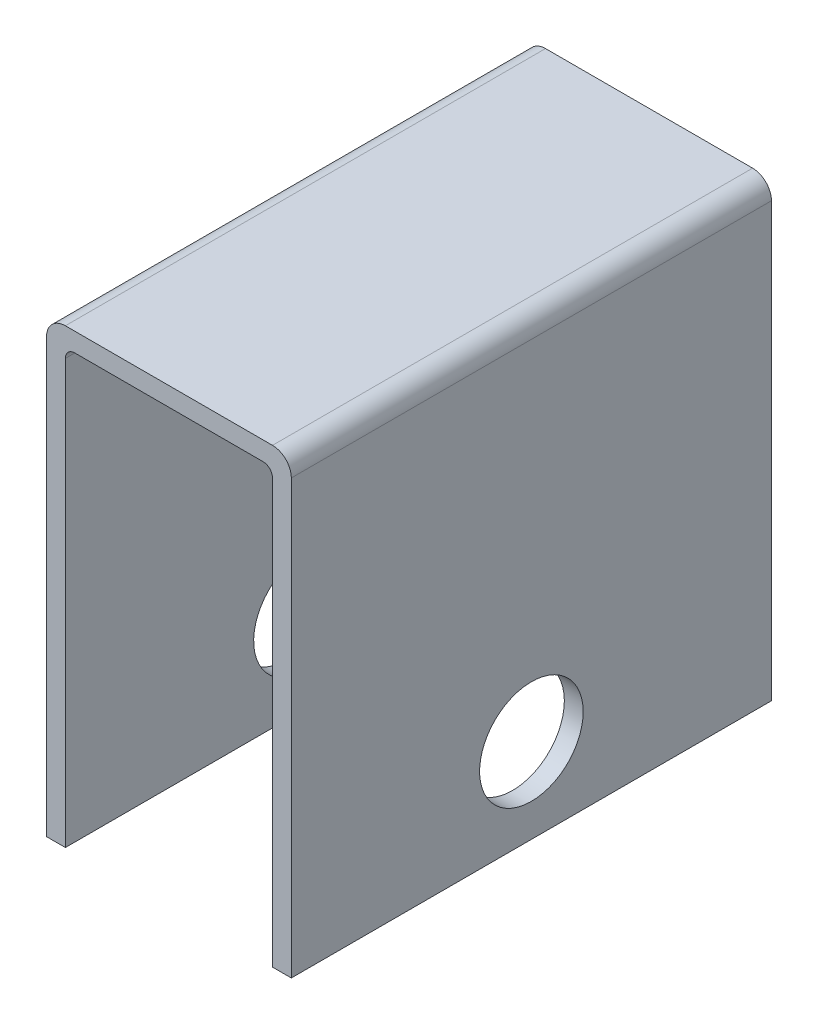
from build123d import *

# Parameters (mm, degrees)
BOSS_EXTRU_1_DEPTH      = 255
ESQUISSE2_R             = 27.5
ENL_V_MAT_EXTRU_1_DEPTH = 374.530453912
CONG_1_R                = 10
CONG_2_R                = 5


with BuildPart() as part:
    # Esquisse1 → Boss.-Extru.1 (new body)
    with BuildSketch(Plane.XY):
        Polygon((10, -240), (0, -240), (0, 0), (130, 0), (130, -240), (120, -240), (120, -10), (10, -10), align=None)
    extrude(amount=BOSS_EXTRU_1_DEPTH)

    # Esquisse2 → Enl_v. mat.-Extru.1 (cut, through all)
    with BuildSketch(Plane(origin=(130, 0, 0), x_dir=(0, 0, -1), z_dir=(1, 0, 0))):
        with Locations((-127.5, -195)):
            Circle(ESQUISSE2_R)
    extrude(amount=-ENL_V_MAT_EXTRU_1_DEPTH, mode=Mode.SUBTRACT)

    # Cong_1
    cong_1_edges = [part.edges().sort_by_distance(p)[0] for p in [
        (0, 0, 127.5),
        (130, 0, 127.5),
    ]]
    fillet(cong_1_edges, radius=CONG_1_R)

    # Cong_2
    cong_2_edges = [part.edges().sort_by_distance(p)[0] for p in [
        (120, -10, 127.5),
        (10, -10, 127.5),
    ]]
    fillet(cong_2_edges, radius=CONG_2_R)


solid = part.part
